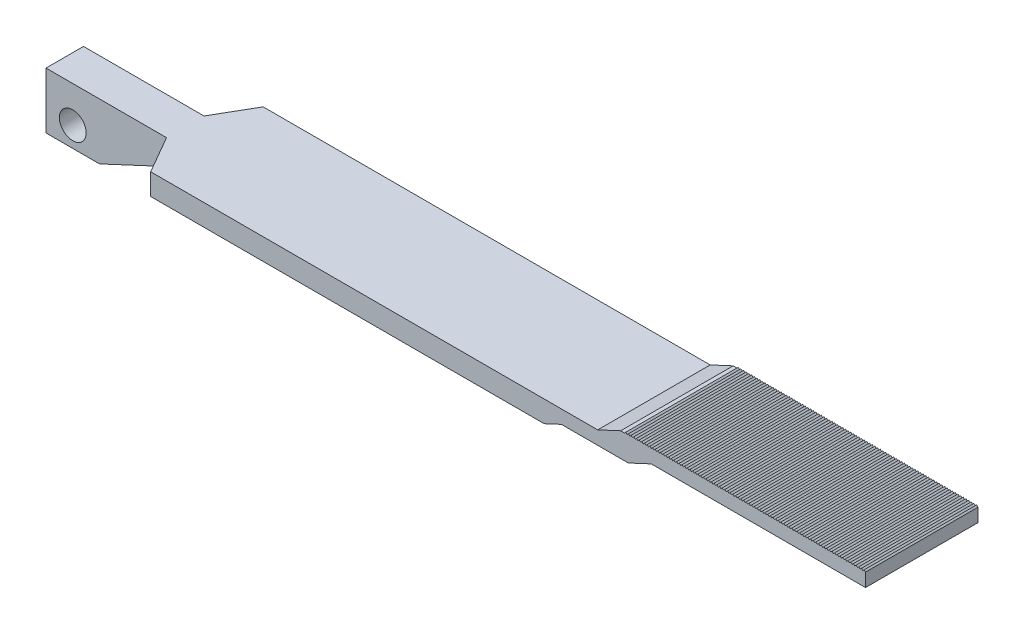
from build123d import *

# Parameters (mm, degrees)
LINEAR_AUSTRAGEN1_DEPTH = 21
LINEAR_AUSTRAGEN2_DEPTH = 21
LINEARES_MUSTER1_COUNT  = 90
LINEARES_MUSTER1_PITCH  = 1
SKIZZE4_R               = 5
LINEAR_AUSTRAGEN3_DEPTH = 60
LINEAR_AUSTRAGEN4_DEPTH = 322.375170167


with BuildPart() as part:
    # Skizze1 → Linear austragen1 (new, symmetric)
    with BuildSketch(Plane.XY):
        Polygon((0, 0), (20, 0), (47.878589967, 13), (200, 13), (206.433520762, 16), (231.421972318, 16), (240, 20), (320, 20), (320, 25), (228.578027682, 25), (220, 21), (0, 21), align=None)
    extrude(amount=LINEAR_AUSTRAGEN1_DEPTH, both=True)

    # Skizze3 → Linear austragen2 (add, symmetric)
    with BuildSketch(Plane.XY):
        Polygon((320, 25), (319, 25), (319.5, 25.5), align=None)
    linear_austragen2 = extrude(amount=LINEAR_AUSTRAGEN2_DEPTH, both=True)

    # Lineares Muster1: Linear austragen2 ×90
    with Locations(*[(-i * LINEARES_MUSTER1_PITCH, 0, 0) for i in range(1, LINEARES_MUSTER1_COUNT)]):
        add(linear_austragen2)

    # Skizze4 → Linear austragen3 (cut)
    with BuildSketch(Plane.XY.offset(21)):
        with Locations((10, 7.5)):
            Circle(SKIZZE4_R)
    extrude(amount=-LINEAR_AUSTRAGEN3_DEPTH, mode=Mode.SUBTRACT)

    # Skizze5 → Linear austragen4 (cut, through all)
    with BuildSketch(Plane(origin=(0, 21, 0), x_dir=(1, 0, 0), z_dir=(0, 1, 0))):
        Polygon((0, 7), (45, 7), (53.082903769, 21), (0, 21), align=None)
        Polygon((0, -7), (45, -7), (53.082903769, -21), (0, -21), align=None)
    extrude(amount=-LINEAR_AUSTRAGEN4_DEPTH, mode=Mode.SUBTRACT)


solid = part.part
